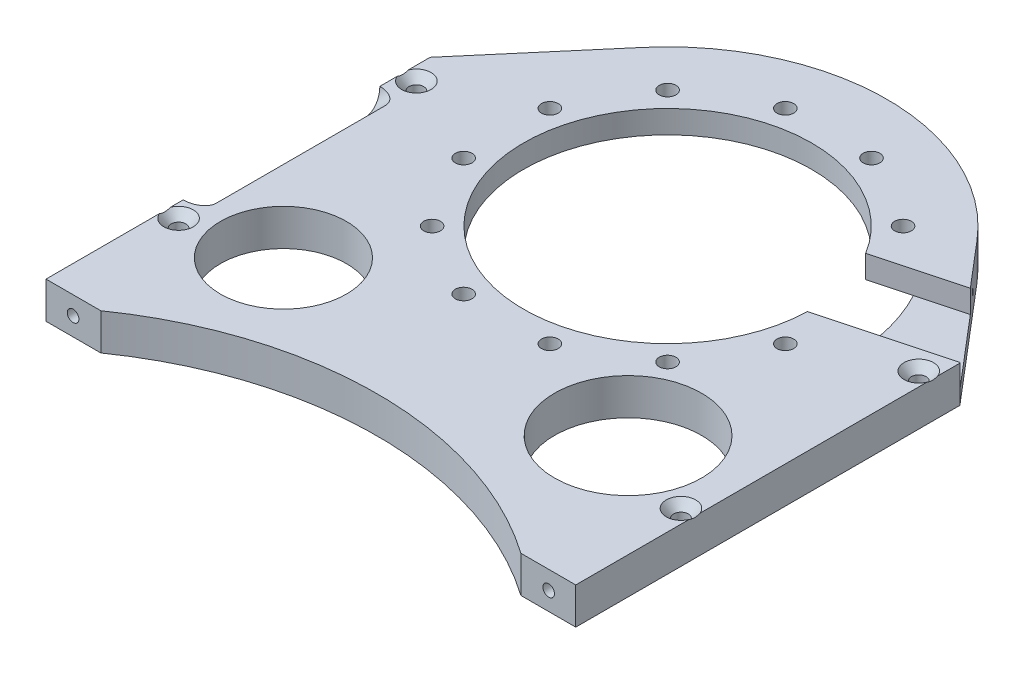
from build123d import *

# Parameters (mm, degrees)
SKETCH1_R                                          = 49.9999
EXTRUDE1_DEPTH                                     = 12.7
SKETCH2_R                                          = 63.0555
EXTRUDE2_DEPTH                                     = 4.7625
NEW_CUT_EXTRUDE2_DEPTH                             = 7.9375
F_5_8_5_8_DIAMETER_HOLE1_D                         = 5.8
CIRPATTERN1_COUNT                                  = 12
CSK_FOR_10_FLAT_HEAD_SOCKET_CAP_SCREW1_D           = 5.1054
CSK_FOR_10_FLAT_HEAD_SOCKET_CAP_SCREW1_CSINK_D     = 10.21334
CSK_FOR_10_FLAT_HEAD_SOCKET_CAP_SCREW1_CSINK_ANGLE = 82
SKETCH11_R                                         = 21.8694
SKETCH11_R_2                                       = 25.527
EXTRUDE9_DEPTH                                     = 244.78711067
F_10_32_TAPPED_HOLE1_D                             = 4.0386
F_10_32_TAPPED_HOLE1_DEPTH                         = 22.225
F_10_32_TAPPED_HOLE1_TIP                           = 1.213317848
CUT_EXTRUDE1_DEPTH                                 = 248.920604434
F_4_40_TAPPED_HOLE1_D                              = 2.2606
F_4_40_TAPPED_HOLE1_DEPTH                          = 8.8646
F_4_40_TAPPED_HOLE1_TIP                            = 0.679152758
F_4_40_TAPPED_HOLE2_D                              = 2.2606
F_4_40_TAPPED_HOLE2_DEPTH                          = 8.8646
F_4_40_TAPPED_HOLE2_TIP                            = 0.679152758


with BuildPart() as part:
    # Sketch1 → Extrude1 (new body)
    with BuildSketch(Plane(origin=(0, 46.8376, 0), x_dir=(-1, 0, 0), z_dir=(0, 1, 0))):
        with BuildLine():
            Line((72.908017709, -25.4), (91.948, -25.4))
            Line((91.948, -25.4), (91.948, -158.75))
            Line((91.948, -158.75), (58.033685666, -198.606487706))
            ThreePointArc((58.033685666, -198.606487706), (0, -225.425), (-58.033685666, -198.606487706))
            Line((-58.033685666, -198.606487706), (-91.948, -158.75))
            Line((-91.948, -158.75), (-91.948, -25.4))
            Line((-91.948, -25.4), (-72.908017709, -25.4))
            ThreePointArc((-72.908017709, -25.4), (0, -48.4124), (72.908017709, -25.4))
        make_face()
        with Locations(Location((0, -149.225, 0), (0, 0, 90))):
            Circle(SKETCH1_R, mode=Mode.SUBTRACT)
    extrude(amount=-EXTRUDE1_DEPTH)

    # Sketch2 → Extrude2 (cut)
    with BuildSketch(Plane.XZ.offset(-34.1376)):
        with Locations(Location((0, -149.225, 0), (0, 0, 270))):
            Circle(SKETCH2_R)
    extrude(amount=-EXTRUDE2_DEPTH, mode=Mode.SUBTRACT)

    # Sketch21 → NEW Cut-Extrude2 (cut)
    with BuildSketch(Plane(origin=(0, 46.8376, 0), x_dir=(1, 0, 0), z_dir=(0, 1, 0))):
        Polygon((3.697877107, 135.424334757), (112.391045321, 164.548581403), (104.995291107, 192.149911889), (-3.697877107, 163.025665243), align=None)
    extrude(amount=-NEW_CUT_EXTRUDE2_DEPTH, mode=Mode.SUBTRACT)

    # 5.8 _5.8_ Diameter Hole1 (through all)
    with Locations(Plane(origin=(0, 46.8376, 0), x_dir=(-1, 0, 0), z_dir=(0, 1, 0))):
        with Locations((-14.959145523, -205.05329113)):
            f_5_8_5_8_diameter_hole1 = Hole(F_5_8_5_8_DIAMETER_HOLE1_D / 2)

    # CirPattern1: 5.8 _5.8_ Diameter Hole1 ×12 about axis
    cirpattern1_axis = Axis((0, 0, -149.225), (0, 1, 0))
    for i in range(1, CIRPATTERN1_COUNT):
        add(f_5_8_5_8_diameter_hole1.rotate(cirpattern1_axis, i * 360 / CIRPATTERN1_COUNT), mode=Mode.SUBTRACT)

    # CSK for _10 Flat Head Socket Cap Screw1 (through all)
    with Locations(Plane(origin=(0, 46.8376, 0), x_dir=(-1, 0, 0), z_dir=(0, 1, 0))):
        with Locations((87.1982, -66.675), (87.1982, -149.225), (-87.1982, -66.675), (-87.1982, -149.225)):
            CounterSinkHole(CSK_FOR_10_FLAT_HEAD_SOCKET_CAP_SCREW1_D / 2, CSK_FOR_10_FLAT_HEAD_SOCKET_CAP_SCREW1_CSINK_D / 2, counter_sink_angle=CSK_FOR_10_FLAT_HEAD_SOCKET_CAP_SCREW1_CSINK_ANGLE)

    # Sketch11 → Extrude9 (cut, through all)
    with BuildSketch(Plane(origin=(0, 46.8376, 0), x_dir=(1, 0, 0), z_dir=(0, 1, 0))):
        with Locations(Location((-57.15, 73.025, 0), (0, 0, 270))):
            Circle(SKETCH11_R)
        with Locations(Location((56.134, 79.375, 0), (0, 0, 270))):
            Circle(SKETCH11_R_2)
    extrude(amount=-EXTRUDE9_DEPTH, mode=Mode.SUBTRACT)

    # 10-32 Tapped Hole1
    with Locations(Plane.XY.offset(-25.4)):
        with Locations((82.55, 40.4876), (-82.55, 40.4876)):
            Hole(F_10_32_TAPPED_HOLE1_D / 2, depth=F_10_32_TAPPED_HOLE1_DEPTH)
            with Locations((0, 0, -(F_10_32_TAPPED_HOLE1_DEPTH + F_10_32_TAPPED_HOLE1_TIP / 2))):  # 118° drill point
                Cone(0, F_10_32_TAPPED_HOLE1_D / 2, F_10_32_TAPPED_HOLE1_TIP, mode=Mode.SUBTRACT)

    # Sketch16 → Cut-Extrude1 (cut, through all)
    with BuildSketch(Plane(origin=(0, 0, 0), x_dir=(-0.7071067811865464, 0.7071067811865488, 0), z_dir=(0.7071067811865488, 0.7071067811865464, 0))):
        with BuildLine():
            Line((93.373738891, -77.7875), (93.373738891, -136.525))
            ThreePointArc((93.373738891, -136.525), (94.768642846, -139.892596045), (98.136238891, -141.2875))
            Line((98.136238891, -141.2875), (98.136238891, -73.025))
            ThreePointArc((98.136238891, -73.025), (94.768642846, -74.419903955), (93.373738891, -77.7875))
        make_face()
    extrude(amount=-CUT_EXTRUDE1_DEPTH, mode=Mode.SUBTRACT)

    # 4-40 Tapped Hole1
    with Locations(Plane(origin=(-131.684231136, 0, -112.051529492), x_dir=(-0.6480510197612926, 0, 0.7615969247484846), z_dir=(-0.7615969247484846, 0, -0.6480510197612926))):
        with Locations((-74.016516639, 40.4876), (-100.951457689, 40.4876)):
            Hole(F_4_40_TAPPED_HOLE1_D / 2, depth=F_4_40_TAPPED_HOLE1_DEPTH)
            with Locations((0, 0, -(F_4_40_TAPPED_HOLE1_DEPTH + F_4_40_TAPPED_HOLE1_TIP / 2))):  # 118° drill point
                Cone(0, F_4_40_TAPPED_HOLE1_D / 2, F_4_40_TAPPED_HOLE1_TIP, mode=Mode.SUBTRACT)

    # 4-40 Tapped Hole2
    with Locations(Plane(origin=(131.684231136, 0, -112.051529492), x_dir=(-0.6480510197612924, 0, -0.7615969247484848), z_dir=(0.7615969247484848, 0, -0.6480510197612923))):
        with Locations((100.940516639, 40.4876), (74.016516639, 40.4876)):
            Hole(F_4_40_TAPPED_HOLE2_D / 2, depth=F_4_40_TAPPED_HOLE2_DEPTH)
            with Locations((0, 0, -(F_4_40_TAPPED_HOLE2_DEPTH + F_4_40_TAPPED_HOLE2_TIP / 2))):  # 118° drill point
                Cone(0, F_4_40_TAPPED_HOLE2_D / 2, F_4_40_TAPPED_HOLE2_TIP, mode=Mode.SUBTRACT)


solid = part.part
